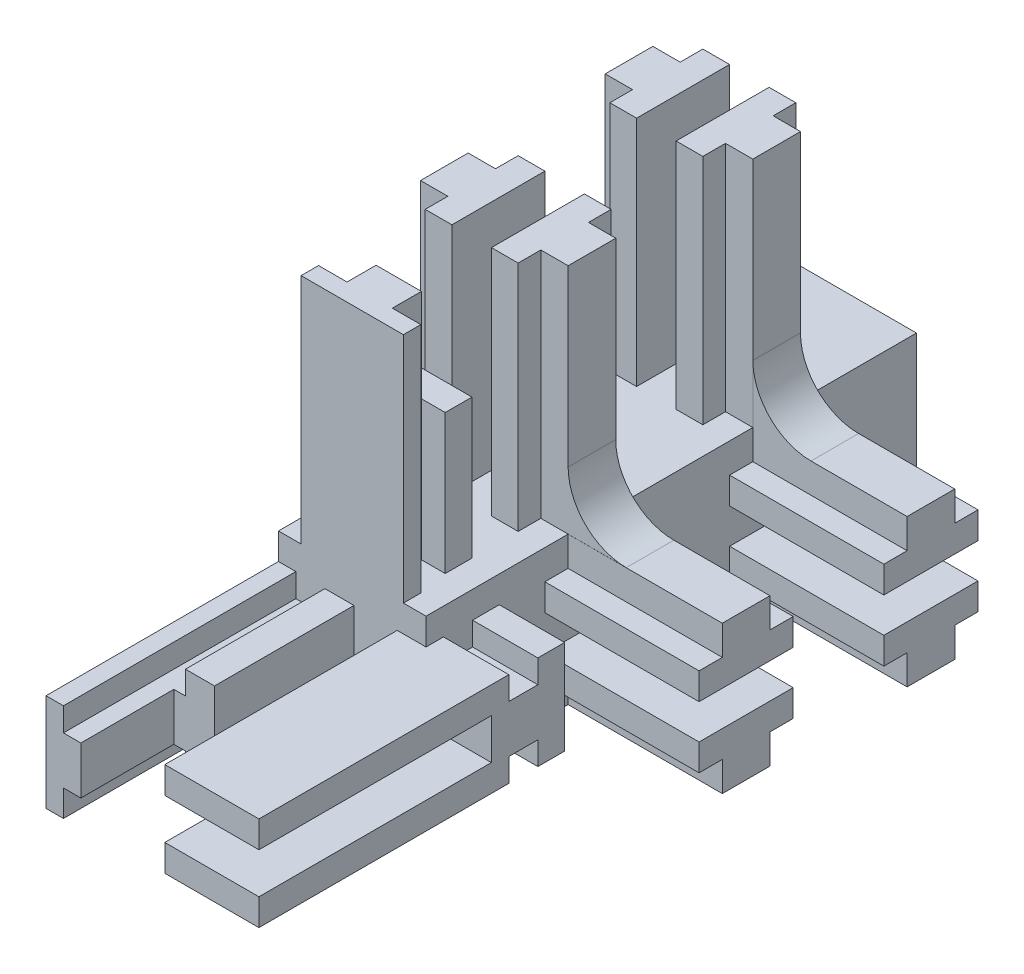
from build123d import *

# Parameters (mm, degrees)
SKETCH1_W                                            = 12.7
SKETCH1_H                                            = 12.7
BOSS_EXTRUDE1_DEPTH                                  = 44.44
BOSS_EXTRUDE3_DEPTH                                  = 20
BOSS_EXTRUDE4_DEPTH                                  = 31.74
BOSS_EXTRUDE5_DEPTH                                  = 20
SKETCH9_W                                            = 20
SKETCH9_H                                            = 8.980906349
CUT_EXTRUDE3_DEPTH                                   = 69.52794693
SKETCH11_W                                           = 8.1
SKETCH11_H                                           = 2.3
BOSS_EXTRUDE6_DEPTH                                  = 20
SKETCH18_W                                           = 3.3
SKETCH18_H                                           = 8.1
CUT_EXTRUDE7_DEPTH                                   = 8
SKETCH19_W                                           = 8
SKETCH19_H                                           = 2.3
CUT_EXTRUDE8_DEPTH                                   = 8
CUT_EXTRUDE9_DEPTH                                   = 8
CSK_FOR_M2_5_CROSS_RECESS_FLAT_HEAD_SCRE_D           = 3.1
CSK_FOR_M2_5_CROSS_RECESS_FLAT_HEAD_SCRE_DEPTH       = 5
CSK_FOR_M2_5_CROSS_RECESS_FLAT_HEAD_SCRE_CSINK_D     = 5.5
CSK_FOR_M2_5_CROSS_RECESS_FLAT_HEAD_SCRE_CSINK_ANGLE = 90
CSK_FOR_M2_5_CROSS_RECESS_FLAT_HEAD_SCRE_TIP         = 0.931333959
CSK_FOR_M2_5_CROSS_RECESS_FLAT_HEAD_2_D              = 3.1
CSK_FOR_M2_5_CROSS_RECESS_FLAT_HEAD_2_DEPTH          = 5
CSK_FOR_M2_5_CROSS_RECESS_FLAT_HEAD_2_CSINK_D        = 5.5
CSK_FOR_M2_5_CROSS_RECESS_FLAT_HEAD_2_CSINK_ANGLE    = 90
CSK_FOR_M2_5_CROSS_RECESS_FLAT_HEAD_2_TIP            = 0.931333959
CUT_EXTRUDE18_DEPTH                                  = 83.1132191
CUT_EXTRUDE18_DEPTH_BACK                             = 83.1132191
SKETCH42_W                                           = 44.44
SKETCH42_H                                           = 7.045
SKETCH43_W                                           = 12.7
SKETCH43_H                                           = 12.7
BOSS_EXTRUDE10_DEPTH                                 = 4.8
SKETCH45_W                                           = 8.25
SKETCH45_H                                           = 20
SKETCH45_W_2                                         = 18.47
SKETCH45_H_2                                         = 24
CUT_EXTRUDE19_DEPTH                                  = 78.931320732
CUT_EXTRUDE21_REACH                                  = 65.62
SKETCH46_W                                           = 29.354561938
SKETCH46_H                                           = 16.697411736
CUT_EXTRUDE21_DIRECTION_2_REACH                      = 65.62
SKETCH47_W                                           = 81.260394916
SKETCH47_H                                           = 46.523126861
CUT_EXTRUDE22_DEPTH                                  = 77.375983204
SKETCH48_W                                           = 6.7
SKETCH48_H                                           = 6.7
CUT_EXTRUDE23_DEPTH                                  = 36
FILLET5_R                                            = 5


with BuildPart() as part:
    # Sketch1 → Boss-Extrude1 (new body)
    with BuildSketch(Plane.XY):
        with Locations((-0.907142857, 0.967619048)):
            Rectangle(SKETCH1_W, SKETCH1_H)
    extrude(amount=BOSS_EXTRUDE1_DEPTH)

    # Sketch4 → Boss-Extrude3 (add)
    with BuildSketch(Plane(origin=(0, 7.317619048, 0), x_dir=(1, 0, 0), z_dir=(0, 1, 0))):
        Polygon((1.042857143, -42.94), (3.492857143, -42.94), (3.492857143, -44.44), (-5.307142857, -44.44), (-5.307142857, -42.94), (-2.857142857, -42.94), (-2.857142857, -40.44), (-4.907142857, -40.44), (-4.907142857, -38.14), (3.092857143, -38.14), (3.092857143, -40.44), (1.042857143, -40.44), align=None)
        Polygon((1.042857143, -1.5), (3.092857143, -1.5), (3.092857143, 0), (-4.907142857, 0), (-4.907142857, -1.5), (-2.857142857, -1.5), (-2.857142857, -4), (-4.907142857, -4), (-4.907142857, -6.3), (3.092857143, -6.3), (3.092857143, -4), (1.042857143, -4), align=None)
        Polygon((-2.607142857, -26.165), (-2.607142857, -34.165), (-4.907142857, -34.165), (-4.907142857, -32.215), (-7.257142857, -32.215), (-7.257142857, -28.115), (-4.907142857, -28.115), (-4.907142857, -26.165), align=None)
        Polygon((0.792857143, -26.165), (0.792857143, -34.165), (3.092857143, -34.165), (3.092857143, -32.215), (5.442857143, -32.215), (5.442857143, -28.115), (3.092857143, -28.115), (3.092857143, -26.165), align=None)
        Polygon((-7.257142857, -16.325), (-7.257142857, -12.225), (-4.907142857, -12.225), (-4.907142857, -10.275), (-2.607142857, -10.275), (-2.607142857, -18.275), (-4.907142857, -18.275), (-4.907142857, -16.325), align=None)
        Polygon((3.092857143, -16.325), (3.092857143, -18.275), (0.792857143, -18.275), (0.792857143, -10.275), (3.092857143, -10.275), (3.092857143, -12.225), (5.442857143, -12.225), (5.442857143, -16.325), align=None)
    extrude(amount=BOSS_EXTRUDE3_DEPTH)

    # Sketch5 → Boss-Extrude4 (add)
    with BuildSketch(Plane.ZY.offset(7.257142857)):
        Polygon((1.5, 3.017619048), (1.5, 5.017619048), (0, 5.017619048), (0, -3.082380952), (1.5, -3.082380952), (1.5, -1.082380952), (4, -1.082380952), (4, -3.082380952), (6.3, -3.082380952), (6.3, 5.017619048), (4, 5.017619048), (4, 3.017619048), align=None)
        Polygon((42.94, 3.017619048), (42.94, 5.017619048), (44.44, 5.017619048), (44.44, -3.082380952), (42.94, -3.082380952), (42.94, -1.082380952), (40.44, -1.082380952), (40.44, -3.082380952), (38.14, -3.082380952), (38.14, 5.017619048), (40.44, 5.017619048), (40.44, 3.017619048), align=None)
        Polygon((16.32, -5.382380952), (12.22, -5.382380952), (12.22, -2.832380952), (10.22, -2.832380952), (10.22, -0.532380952), (18.32, -0.532380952), (18.32, -2.832380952), (16.32, -2.832380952), align=None)
        Polygon((16.32, 4.767619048), (18.32, 4.767619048), (18.32, 2.467619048), (10.22, 2.467619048), (10.22, 4.767619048), (12.22, 4.767619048), (12.22, 7.317619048), (16.32, 7.317619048), align=None)
        Polygon((26.12, -0.532380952), (34.22, -0.532380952), (34.22, -2.832380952), (32.22, -2.832380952), (32.22, -5.382380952), (28.12, -5.382380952), (28.12, -2.832380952), (26.12, -2.832380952), align=None)
        Polygon((26.12, 2.467619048), (34.22, 2.467619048), (34.22, 4.767619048), (32.22, 4.767619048), (32.22, 7.317619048), (28.12, 7.317619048), (28.12, 4.767619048), (26.12, 4.767619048), align=None)
    extrude(amount=BOSS_EXTRUDE4_DEPTH)

    # Sketch6 → Boss-Extrude5 (add)
    with BuildSketch(Plane(origin=(0, 0, 0), x_dir=(-1, 0, 0), z_dir=(0, 0, -1))):
        Polygon((1.857156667, 5.458072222), (-1.442843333, 5.458072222), (-1.442879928, 3.358072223), (-3.442857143, 3.367619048), (-3.442857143, -1.432380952), (-1.442879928, -1.422834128), (-1.442843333, -3.522834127), (1.857156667, -3.522834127), align=None)
    extrude(amount=BOSS_EXTRUDE5_DEPTH)

    # Sketch9 → Cut-Extrude3 (cut, through all)
    with BuildSketch(Plane(origin=(5.442857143, 0, 0), x_dir=(0, 0, -1), z_dir=(1, 0, 0))):
        with Locations((10, 0.967619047)):
            Rectangle(SKETCH9_W, SKETCH9_H)
    extrude(amount=-CUT_EXTRUDE3_DEPTH, mode=Mode.SUBTRACT)

    # Sketch11 → Boss-Extrude6 (add)
    with BuildSketch(Plane.XY.offset(44.44)):
        Polygon((3.942857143, 3.017619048), (3.942857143, 5.039728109), (5.442857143, 5.039728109), (5.442857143, -3.360271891), (3.942857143, -3.360271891), (3.942857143, -1.082380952), (1.442857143, -1.082380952), (1.442857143, -3.082380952), (-1.057142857, -3.082380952), (-1.057142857, 5.017619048), (1.442857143, 5.017619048), (1.442857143, 3.017619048), align=None)
        with Locations((-8.827142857, -1.932380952)):
            Rectangle(SKETCH11_W, SKETCH11_H)
        with Locations((-8.827142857, 3.867619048)):
            Rectangle(SKETCH11_W, SKETCH11_H)
        with Locations((-24.727142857, -1.932380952)):
            Rectangle(SKETCH11_W, SKETCH11_H)
        with Locations((-24.727142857, 3.867619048)):
            Rectangle(SKETCH11_W, SKETCH11_H)
        Polygon((-34.997142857, -1.082380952), (-37.497142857, -1.082380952), (-37.497142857, -3.082380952), (-38.997142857, -3.082380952), (-38.997142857, 5.017619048), (-37.497142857, 5.017619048), (-37.497142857, 3.017619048), (-34.997142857, 3.017619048), (-34.997142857, 5.017619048), (-32.497142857, 5.017619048), (-32.497142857, -3.082380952), (-34.997142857, -3.082380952), align=None)
    extrude(amount=BOSS_EXTRUDE6_DEPTH)

    # Sketch18 → Cut-Extrude7 (cut)
    with BuildSketch(Plane.ZY.offset(38.997142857)):
        with Locations((4.65, 0.967619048)):
            Rectangle(SKETCH18_W, SKETCH18_H)
    extrude(amount=-CUT_EXTRUDE7_DEPTH, mode=Mode.SUBTRACT)

    # Sketch19 → Cut-Extrude8 (cut)
    with BuildSketch(Plane(origin=(0, 27.317619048, 0), x_dir=(1, 0, 0), z_dir=(0, 1, 0))):
        with Locations((-0.907142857, -5.15)):
            Rectangle(SKETCH19_W, SKETCH19_H)
        with Locations((-0.907142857, -39.29)):
            Rectangle(SKETCH19_W, SKETCH19_H)
    extrude(amount=-CUT_EXTRUDE8_DEPTH, mode=Mode.SUBTRACT)

    # Sketch21 → Cut-Extrude9 (cut)
    with BuildSketch(Plane.XY.offset(64.44)):
        Polygon((-35.997142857, 3.239728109), (-36.02657045, -3.378044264), (-32.497142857, -3.378044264), (-32.497142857, 5.017619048), (-35.997142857, 5.017619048), align=None)
        Polygon((2.442857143, 5.039728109), (-1.057142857, 5.039728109), (-1.057142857, -3.082380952), (2.142857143, -3.082380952), (2.442857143, -1.560271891), align=None)
    extrude(amount=-CUT_EXTRUDE9_DEPTH, mode=Mode.SUBTRACT)

    # CSK for M2.5 Cross Recess Flat Head Scre
    with Locations(Plane(origin=(0, 0, 0), x_dir=(-1, 0, 0), z_dir=(0, 0, -1))):
        with Locations((33.997142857, 0.839728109), (0.907142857, 22.317619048)):
            CounterSinkHole(CSK_FOR_M2_5_CROSS_RECESS_FLAT_HEAD_SCRE_D / 2, CSK_FOR_M2_5_CROSS_RECESS_FLAT_HEAD_SCRE_CSINK_D / 2, depth=CSK_FOR_M2_5_CROSS_RECESS_FLAT_HEAD_SCRE_DEPTH, counter_sink_angle=CSK_FOR_M2_5_CROSS_RECESS_FLAT_HEAD_SCRE_CSINK_ANGLE)
            with Locations((0, 0, -(CSK_FOR_M2_5_CROSS_RECESS_FLAT_HEAD_SCRE_DEPTH + CSK_FOR_M2_5_CROSS_RECESS_FLAT_HEAD_SCRE_TIP / 2))):  # 118° drill point
                Cone(0, CSK_FOR_M2_5_CROSS_RECESS_FLAT_HEAD_SCRE_D / 2, CSK_FOR_M2_5_CROSS_RECESS_FLAT_HEAD_SCRE_TIP, mode=Mode.SUBTRACT)

    # CSK for M2.5 Cross Recess Flat Head  2
    with Locations(Plane.ZY.offset(38.997142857)):
        with Locations((59.44, 0.839728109)):
            CounterSinkHole(CSK_FOR_M2_5_CROSS_RECESS_FLAT_HEAD_2_D / 2, CSK_FOR_M2_5_CROSS_RECESS_FLAT_HEAD_2_CSINK_D / 2, depth=CSK_FOR_M2_5_CROSS_RECESS_FLAT_HEAD_2_DEPTH, counter_sink_angle=CSK_FOR_M2_5_CROSS_RECESS_FLAT_HEAD_2_CSINK_ANGLE)
            with Locations((0, 0, -(CSK_FOR_M2_5_CROSS_RECESS_FLAT_HEAD_2_DEPTH + CSK_FOR_M2_5_CROSS_RECESS_FLAT_HEAD_2_TIP / 2))):  # 118° drill point
                Cone(0, CSK_FOR_M2_5_CROSS_RECESS_FLAT_HEAD_2_D / 2, CSK_FOR_M2_5_CROSS_RECESS_FLAT_HEAD_2_TIP, mode=Mode.SUBTRACT)

    # Sketch42 → Cut-Extrude18 (cut, two sides: drawn at the far end of the back side and taken through both)
    with BuildSketch(Plane(origin=(0, 27.317619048, 0), x_dir=(1, 0, 0), z_dir=(0, 1, 0)).offset(-CUT_EXTRUDE18_DEPTH_BACK)):
        with Locations((-16.777142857, -3.5225)):
            Rectangle(SKETCH42_W, SKETCH42_H)
    extrude(amount=CUT_EXTRUDE18_DEPTH + CUT_EXTRUDE18_DEPTH_BACK, mode=Mode.SUBTRACT)

    # Sketch43 → Boss-Extrude10 (add)
    with BuildSketch(Plane(origin=(0, 0, 7.045), x_dir=(-1, 0, 0), z_dir=(0, 0, -1))):
        with Locations((0.907142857, 0.967619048)):
            Rectangle(SKETCH43_W, SKETCH43_H)
    extrude(amount=BOSS_EXTRUDE10_DEPTH)

    # Sketch45 → Cut-Extrude19 (cut, through all)
    with BuildSketch(Plane(origin=(0, 7.317619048, 0), x_dir=(1, 0, 0), z_dir=(0, 1, 0))):
        with Locations((-24.802142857, -54.44)):
            Rectangle(SKETCH45_W, SKETCH45_H)
        with Locations((-29.762142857, -22.22)):
            Rectangle(SKETCH45_W_2, SKETCH45_H_2)
    extrude(amount=-CUT_EXTRUDE19_DEPTH, mode=Mode.SUBTRACT)

    # Cut-Extrude21: up to this face of the body (flat: up to its plane)
    cut_extrude21_end = Plane(part.part.faces().sort_by_distance((-23.127142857, 0.967619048, 38.14))[0])
    # Sketch46 → Cut-Extrude21 (cut, up to the picked face)
    with BuildSketch(Plane.XY.offset(44.44), mode=Mode.PRIVATE) as cut_extrude21_sk1:
        with Locations((-27.554423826, 1.448099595)):
            Rectangle(SKETCH46_W, SKETCH46_H)
    cut_extrude21_tool1 = split(extrude(cut_extrude21_sk1.sketch, amount=-CUT_EXTRUDE21_REACH, mode=Mode.PRIVATE), bisect_by=cut_extrude21_end, keep=Keep.BOTH, mode=Mode.PRIVATE)
    add(cut_extrude21_tool1.solids().sort_by(Axis((-27.554424, 1.4481, 44.44), (0, 0, -1)))[0], mode=Mode.SUBTRACT)

    # Cut-Extrude21 direction 2: up to this face of the body (flat: up to its plane)
    cut_extrude21_direction_2_end = Plane(part.part.faces().sort_by_distance((-37.746990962, 0.969017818, 64.44))[0])
    # Sketch46 → Cut-Extrude21 direction 2 (cut, up to the picked face)
    with BuildSketch(Plane.XY.offset(44.44), mode=Mode.PRIVATE) as cut_extrude21_direction_2_sk1:
        with Locations((-27.554423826, 1.448099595)):
            Rectangle(SKETCH46_W, SKETCH46_H)
    cut_extrude21_direction_2_tool1 = split(extrude(cut_extrude21_direction_2_sk1.sketch, amount=CUT_EXTRUDE21_DIRECTION_2_REACH, mode=Mode.PRIVATE), bisect_by=cut_extrude21_direction_2_end, keep=Keep.BOTH, mode=Mode.PRIVATE)
    add(cut_extrude21_direction_2_tool1.solids().sort_by(Axis((-27.554424, 1.4481, 44.44), (0, 0, 1)))[0], mode=Mode.SUBTRACT)


with BuildPart() as body_2:
    # Mirror2: mirrored copy
    add(part.part.mirror(Plane(origin=(7.742857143, 0, 0), x_dir=(0, 0, 1), z_dir=(1, 0, 0))))

    # Sketch48 → Cut-Extrude23 (cut)
    with BuildSketch(Plane(origin=(0, 0, 5.245), x_dir=(-1, 0, 0), z_dir=(0, 0, -1))):
        with Locations((-16.392857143, 0.967619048)):
            Rectangle(SKETCH48_W, SKETCH48_H)
    extrude(amount=-CUT_EXTRUDE23_DEPTH, mode=Mode.SUBTRACT)

    # Fillet5
    fillet5_edges = [body_2.edges().sort_by_distance(p)[0] for p in [
        (22.742857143, 7.317619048, 14.2725),
        (22.742857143, 7.317619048, 30.1675),
    ]]
    fillet(fillet5_edges, radius=FILLET5_R)


with BuildPart() as part_1:
    add(part.part)

    # Sketch47 → Cut-Extrude22 (cut, through all)
    with BuildSketch(Plane(origin=(5.442857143, 0, 0), x_dir=(0, 0, -1), z_dir=(1, 0, 0))):
        with Locations((-36.00982594, 10.277934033)):
            Rectangle(SKETCH47_W, SKETCH47_H)
    extrude(amount=-CUT_EXTRUDE22_DEPTH, mode=Mode.SUBTRACT)


solid = body_2.part
